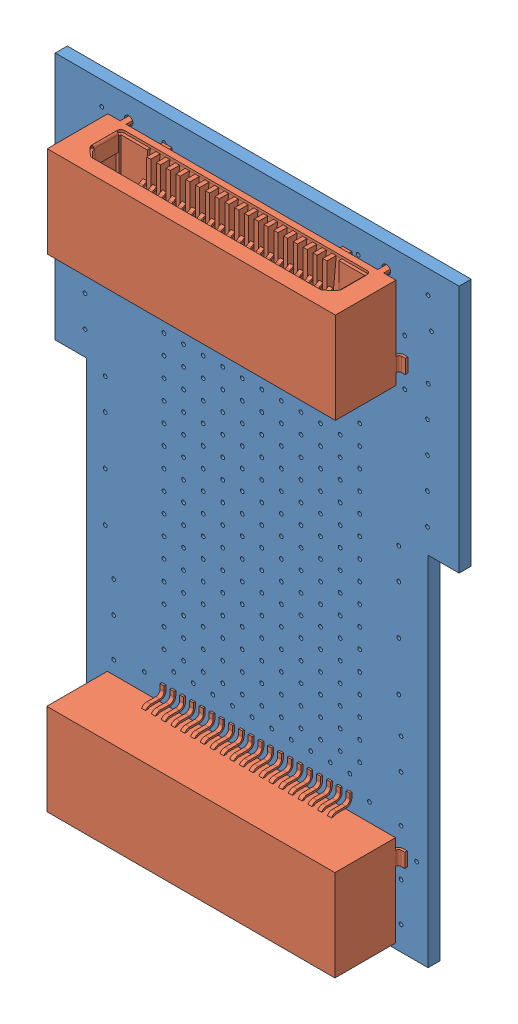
SolidWorks assembly Ingress05.SLDASM, configuration Default (file format 9000). Lengths in mm.
Overall size (33.02 49.53 6.8).
3 component instances, 2 part files, 0 mates.
Components (placement in the parent):
- Board_ingress05_solid-1: Board_ingress05_solid.sldprt [Default] at origin size (33.02 49.53 0.99)
- FCS8-20-01-L-S-A-TR-1: FCS8-20-01-L-S-A-TR.sldprt [Default] at (15.26 -2.42 0.45) x (1 0 0) z (0 -1 0) size (24.59 6.8 8.45)
- FCS8-20-01-L-S-A-TR-2: FCS8-20-01-L-S-A-TR.sldprt [Default] at (15.3 44.54 0.45) x (-1 0 0) z (0 1 0) size (24.59 6.8 8.45)
